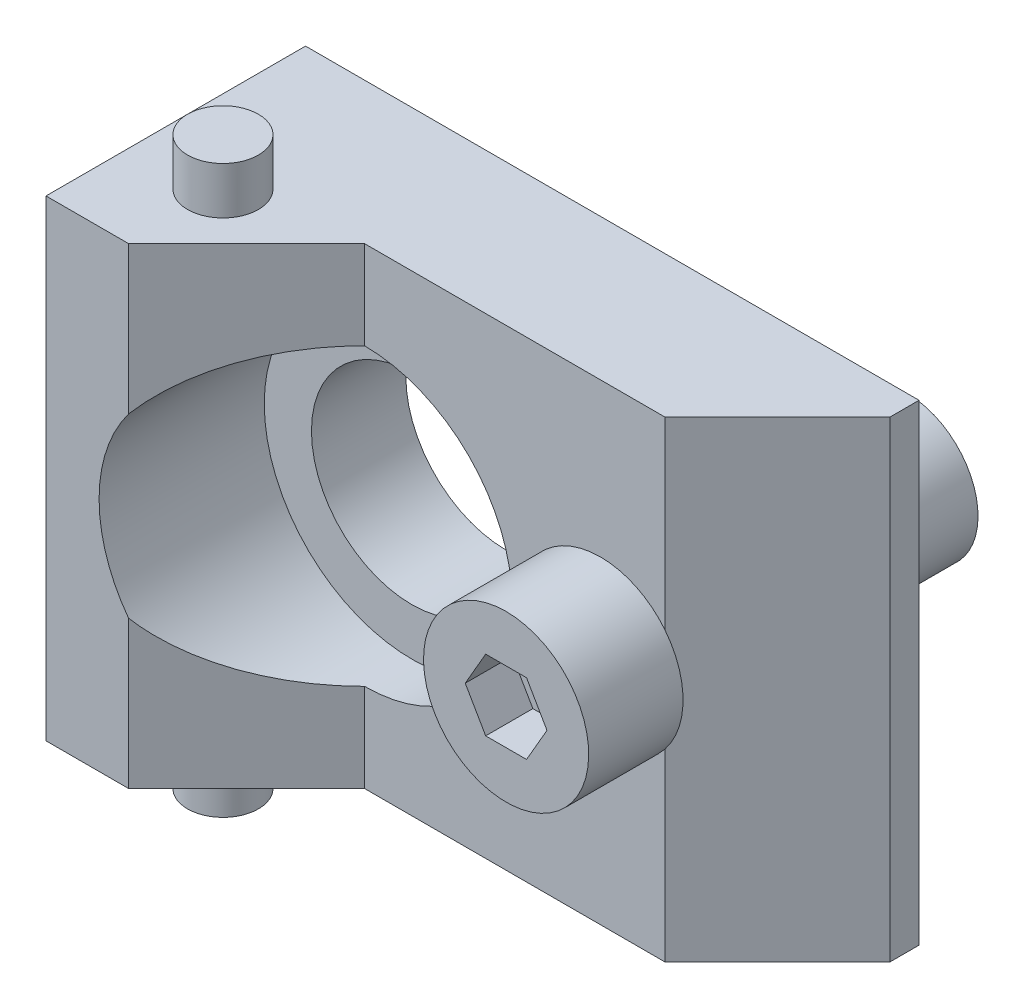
ISO-10303-21;
HEADER;
FILE_DESCRIPTION(('STEP AP214'),'2;1');
FILE_NAME('part.step','',(''),(''),'','','');
FILE_SCHEMA(('AUTOMOTIVE_DESIGN { 1 0 10303 214 1 1 1 1 }'));
ENDSEC;
DATA;
#1=APPLICATION_CONTEXT('core data for automotive mechanical design processes');
#2=APPLICATION_PROTOCOL_DEFINITION('international standard','automotive_design',2000,#1);
#3=PRODUCT_CONTEXT('',#1,'mechanical');
#4=PRODUCT('Part','Part','',(#3));
#5=PRODUCT_RELATED_PRODUCT_CATEGORY('part','',(#4));
#6=PRODUCT_DEFINITION_FORMATION('','',#4);
#7=PRODUCT_DEFINITION_CONTEXT('part definition',#1,'design');
#8=PRODUCT_DEFINITION('design','',#6,#7);
#9=PRODUCT_DEFINITION_SHAPE('','',#8);
#10=(LENGTH_UNIT() NAMED_UNIT(*) SI_UNIT(.MILLI.,.METRE.));
#11=(NAMED_UNIT(*) PLANE_ANGLE_UNIT() SI_UNIT($,.RADIAN.));
#12=(NAMED_UNIT(*) SI_UNIT($,.STERADIAN.) SOLID_ANGLE_UNIT());
#13=UNCERTAINTY_MEASURE_WITH_UNIT(LENGTH_MEASURE(1.E-05),#10,'distance_accuracy_value','');
#14=(GEOMETRIC_REPRESENTATION_CONTEXT(3) GLOBAL_UNCERTAINTY_ASSIGNED_CONTEXT((#13)) GLOBAL_UNIT_ASSIGNED_CONTEXT((#10,
#11,#12)) REPRESENTATION_CONTEXT('',''));
#15=CARTESIAN_POINT('',(0.,0.,0.));
#16=DIRECTION('',(0.,0.,1.));
#17=DIRECTION('',(1.,0.,0.));
#18=AXIS2_PLACEMENT_3D('',#15,#16,#17);
#19=CARTESIAN_POINT('',(-15.,-12.,7.));
#20=DIRECTION('',(0.,1.,0.));
#21=DIRECTION('',(1.,0.,0.));
#22=AXIS2_PLACEMENT_3D('',#19,#20,#21);
#23=CYLINDRICAL_SURFACE('',#22,1.5);
#24=CARTESIAN_POINT('',(-15.,-12.,7.));
#25=DIRECTION('',(0.,-1.,0.));
#26=DIRECTION('',(-1.,0.,0.));
#27=AXIS2_PLACEMENT_3D('',#24,#25,#26);
#28=CIRCLE('',#27,1.5);
#29=CARTESIAN_POINT('',(-16.5,-12.,7.00000000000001));
#30=VERTEX_POINT('',#29);
#31=EDGE_CURVE('E21',#30,#30,#28,.T.);
#32=ORIENTED_EDGE('',*,*,#31,.F.);
#33=EDGE_LOOP('',(#32));
#34=FACE_BOUND('',#33,.T.);
#35=CARTESIAN_POINT('',(-15.,-10.,7.));
#36=DIRECTION('',(0.,1.,0.));
#37=DIRECTION('',(0.,0.,1.));
#38=AXIS2_PLACEMENT_3D('',#35,#36,#37);
#39=CIRCLE('',#38,1.5);
#40=CARTESIAN_POINT('',(-15.,-10.,8.5));
#41=VERTEX_POINT('',#40);
#42=EDGE_CURVE('E9',#41,#41,#39,.T.);
#43=ORIENTED_EDGE('',*,*,#42,.F.);
#44=EDGE_LOOP('',(#43));
#45=FACE_BOUND('',#44,.T.);
#46=ADVANCED_FACE('F14',(#34,#45),#23,.T.);
#47=CARTESIAN_POINT('',(-15.,-12.,7.));
#48=DIRECTION('',(0.,-1.,0.));
#49=DIRECTION('',(-1.,0.,0.));
#50=AXIS2_PLACEMENT_3D('',#47,#48,#49);
#51=PLANE('',#50);
#52=ORIENTED_EDGE('',*,*,#31,.T.);
#53=EDGE_LOOP('',(#52));
#54=FACE_BOUND('',#53,.T.);
#55=ADVANCED_FACE('F239',(#54),#51,.T.);
#56=CARTESIAN_POINT('',(-0.866025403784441,1.5,8.));
#57=DIRECTION('',(0.,0.,1.));
#58=DIRECTION('',(0.,1.,0.));
#59=AXIS2_PLACEMENT_3D('',#56,#57,#58);
#60=PLANE('',#59);
#61=DIRECTION('',(0.5,0.86602540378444,0.));
#62=VECTOR('',#61,1.);
#63=CARTESIAN_POINT('',(-1.73205080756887,0.,8.));
#64=LINE('',#63,#62);
#65=CARTESIAN_POINT('',(-1.73205080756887,0.,8.));
#66=VERTEX_POINT('',#65);
#67=CARTESIAN_POINT('',(-0.866025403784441,1.5,8.));
#68=VERTEX_POINT('',#67);
#69=EDGE_CURVE('E174',#66,#68,#64,.T.);
#70=ORIENTED_EDGE('',*,*,#69,.F.);
#71=DIRECTION('',(0.5,-0.86602540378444,0.));
#72=VECTOR('',#71,1.);
#73=CARTESIAN_POINT('',(-1.73205080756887,0.,8.));
#74=LINE('',#73,#72);
#75=CARTESIAN_POINT('',(-0.866025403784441,-1.5,8.));
#76=VERTEX_POINT('',#75);
#77=EDGE_CURVE('E189',#66,#76,#74,.T.);
#78=ORIENTED_EDGE('',*,*,#77,.T.);
#79=DIRECTION('',(1.,0.,0.));
#80=VECTOR('',#79,1.);
#81=CARTESIAN_POINT('',(-0.866025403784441,-1.5,8.));
#82=LINE('',#81,#80);
#83=CARTESIAN_POINT('',(0.866025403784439,-1.5,8.));
#84=VERTEX_POINT('',#83);
#85=EDGE_CURVE('E193',#76,#84,#82,.T.);
#86=ORIENTED_EDGE('',*,*,#85,.T.);
#87=DIRECTION('',(-0.5,-0.86602540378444,0.));
#88=VECTOR('',#87,1.);
#89=CARTESIAN_POINT('',(1.73205080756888,0.,8.));
#90=LINE('',#89,#88);
#91=CARTESIAN_POINT('',(1.73205080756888,0.,8.));
#92=VERTEX_POINT('',#91);
#93=EDGE_CURVE('E196',#92,#84,#90,.T.);
#94=ORIENTED_EDGE('',*,*,#93,.F.);
#95=DIRECTION('',(-0.5,0.86602540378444,0.));
#96=VECTOR('',#95,1.);
#97=CARTESIAN_POINT('',(1.73205080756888,0.,8.));
#98=LINE('',#97,#96);
#99=CARTESIAN_POINT('',(0.866025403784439,1.5,8.));
#100=VERTEX_POINT('',#99);
#101=EDGE_CURVE('E199',#92,#100,#98,.T.);
#102=ORIENTED_EDGE('',*,*,#101,.T.);
#103=DIRECTION('',(-1.,0.,0.));
#104=VECTOR('',#103,1.);
#105=CARTESIAN_POINT('',(0.866025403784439,1.5,8.));
#106=LINE('',#105,#104);
#107=EDGE_CURVE('E202',#100,#68,#106,.T.);
#108=ORIENTED_EDGE('',*,*,#107,.T.);
#109=EDGE_LOOP('',(#70,#78,#86,#94,#102,#108));
#110=FACE_BOUND('',#109,.T.);
#111=ADVANCED_FACE('F257',(#110),#60,.T.);
#112=CARTESIAN_POINT('',(-0.866025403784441,-1.5,8.));
#113=DIRECTION('',(0.,-1.,0.));
#114=DIRECTION('',(1.,0.,0.));
#115=AXIS2_PLACEMENT_3D('',#112,#113,#114);
#116=PLANE('',#115);
#117=DIRECTION('',(0.,0.,1.));
#118=VECTOR('',#117,1.);
#119=CARTESIAN_POINT('',(-0.866025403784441,-1.5,8.));
#120=LINE('',#119,#118);
#121=CARTESIAN_POINT('',(-0.866025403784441,-1.5,10.));
#122=VERTEX_POINT('',#121);
#123=EDGE_CURVE('E209',#76,#122,#120,.T.);
#124=ORIENTED_EDGE('',*,*,#123,.T.);
#125=DIRECTION('',(1.,0.,0.));
#126=VECTOR('',#125,1.);
#127=CARTESIAN_POINT('',(-0.866025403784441,-1.5,10.));
#128=LINE('',#127,#126);
#129=CARTESIAN_POINT('',(0.866025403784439,-1.5,10.));
#130=VERTEX_POINT('',#129);
#131=EDGE_CURVE('E175',#122,#130,#128,.T.);
#132=ORIENTED_EDGE('',*,*,#131,.T.);
#133=DIRECTION('',(0.,0.,1.));
#134=VECTOR('',#133,1.);
#135=CARTESIAN_POINT('',(0.866025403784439,-1.5,8.));
#136=LINE('',#135,#134);
#137=EDGE_CURVE('E211',#84,#130,#136,.T.);
#138=ORIENTED_EDGE('',*,*,#137,.F.);
#139=ORIENTED_EDGE('',*,*,#85,.F.);
#140=EDGE_LOOP('',(#124,#132,#138,#139));
#141=FACE_BOUND('',#140,.T.);
#142=ADVANCED_FACE('F259',(#141),#116,.F.);
#143=CARTESIAN_POINT('',(1.73205080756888,0.,8.));
#144=DIRECTION('',(-0.86602540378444,0.5,0.));
#145=DIRECTION('',(-0.5,-0.86602540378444,0.));
#146=AXIS2_PLACEMENT_3D('',#143,#144,#145);
#147=PLANE('',#146);
#148=ORIENTED_EDGE('',*,*,#137,.T.);
#149=DIRECTION('',(-0.5,-0.86602540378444,0.));
#150=VECTOR('',#149,1.);
#151=CARTESIAN_POINT('',(1.73205080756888,0.,10.));
#152=LINE('',#151,#150);
#153=CARTESIAN_POINT('',(1.73205080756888,0.,10.));
#154=VERTEX_POINT('',#153);
#155=EDGE_CURVE('E178',#154,#130,#152,.T.);
#156=ORIENTED_EDGE('',*,*,#155,.F.);
#157=DIRECTION('',(0.,0.,1.));
#158=VECTOR('',#157,1.);
#159=CARTESIAN_POINT('',(1.73205080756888,0.,8.));
#160=LINE('',#159,#158);
#161=EDGE_CURVE('E213',#92,#154,#160,.T.);
#162=ORIENTED_EDGE('',*,*,#161,.F.);
#163=ORIENTED_EDGE('',*,*,#93,.T.);
#164=EDGE_LOOP('',(#148,#156,#162,#163));
#165=FACE_BOUND('',#164,.T.);
#166=ADVANCED_FACE('F267',(#165),#147,.T.);
#167=CARTESIAN_POINT('',(1.73205080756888,0.,8.));
#168=DIRECTION('',(0.86602540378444,0.5,0.));
#169=DIRECTION('',(-0.5,0.86602540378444,0.));
#170=AXIS2_PLACEMENT_3D('',#167,#168,#169);
#171=PLANE('',#170);
#172=ORIENTED_EDGE('',*,*,#161,.T.);
#173=DIRECTION('',(-0.5,0.86602540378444,0.));
#174=VECTOR('',#173,1.);
#175=CARTESIAN_POINT('',(1.73205080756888,0.,10.));
#176=LINE('',#175,#174);
#177=CARTESIAN_POINT('',(0.866025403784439,1.5,10.));
#178=VERTEX_POINT('',#177);
#179=EDGE_CURVE('E181',#154,#178,#176,.T.);
#180=ORIENTED_EDGE('',*,*,#179,.T.);
#181=DIRECTION('',(0.,0.,1.));
#182=VECTOR('',#181,1.);
#183=CARTESIAN_POINT('',(0.866025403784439,1.5,8.));
#184=LINE('',#183,#182);
#185=EDGE_CURVE('E215',#100,#178,#184,.T.);
#186=ORIENTED_EDGE('',*,*,#185,.F.);
#187=ORIENTED_EDGE('',*,*,#101,.F.);
#188=EDGE_LOOP('',(#172,#180,#186,#187));
#189=FACE_BOUND('',#188,.T.);
#190=ADVANCED_FACE('F287',(#189),#171,.F.);
#191=CARTESIAN_POINT('',(0.866025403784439,1.5,8.));
#192=DIRECTION('',(0.,1.,0.));
#193=DIRECTION('',(-1.,0.,0.));
#194=AXIS2_PLACEMENT_3D('',#191,#192,#193);
#195=PLANE('',#194);
#196=ORIENTED_EDGE('',*,*,#185,.T.);
#197=DIRECTION('',(-1.,0.,0.));
#198=VECTOR('',#197,1.);
#199=CARTESIAN_POINT('',(0.866025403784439,1.5,10.));
#200=LINE('',#199,#198);
#201=CARTESIAN_POINT('',(-0.866025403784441,1.5,10.));
#202=VERTEX_POINT('',#201);
#203=EDGE_CURVE('E184',#178,#202,#200,.T.);
#204=ORIENTED_EDGE('',*,*,#203,.T.);
#205=DIRECTION('',(0.,0.,1.));
#206=VECTOR('',#205,1.);
#207=CARTESIAN_POINT('',(-0.866025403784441,1.5,8.));
#208=LINE('',#207,#206);
#209=EDGE_CURVE('E217',#68,#202,#208,.T.);
#210=ORIENTED_EDGE('',*,*,#209,.F.);
#211=ORIENTED_EDGE('',*,*,#107,.F.);
#212=EDGE_LOOP('',(#196,#204,#210,#211));
#213=FACE_BOUND('',#212,.T.);
#214=ADVANCED_FACE('F279',(#213),#195,.F.);
#215=CARTESIAN_POINT('',(-1.73205080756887,0.,8.));
#216=DIRECTION('',(0.86602540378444,-0.5,0.));
#217=DIRECTION('',(0.5,0.86602540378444,0.));
#218=AXIS2_PLACEMENT_3D('',#215,#216,#217);
#219=PLANE('',#218);
#220=ORIENTED_EDGE('',*,*,#209,.T.);
#221=DIRECTION('',(0.5,0.86602540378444,0.));
#222=VECTOR('',#221,1.);
#223=CARTESIAN_POINT('',(-1.73205080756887,0.,10.));
#224=LINE('',#223,#222);
#225=CARTESIAN_POINT('',(-1.73205080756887,0.,10.));
#226=VERTEX_POINT('',#225);
#227=EDGE_CURVE('E170',#226,#202,#224,.T.);
#228=ORIENTED_EDGE('',*,*,#227,.F.);
#229=DIRECTION('',(0.,0.,1.));
#230=VECTOR('',#229,1.);
#231=CARTESIAN_POINT('',(-1.73205080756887,0.,8.));
#232=LINE('',#231,#230);
#233=EDGE_CURVE('E192',#66,#226,#232,.T.);
#234=ORIENTED_EDGE('',*,*,#233,.F.);
#235=ORIENTED_EDGE('',*,*,#69,.T.);
#236=EDGE_LOOP('',(#220,#228,#234,#235));
#237=FACE_BOUND('',#236,.T.);
#238=ADVANCED_FACE('F275',(#237),#219,.T.);
#239=CARTESIAN_POINT('',(-1.73205080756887,0.,8.));
#240=DIRECTION('',(-0.86602540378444,-0.5,0.));
#241=DIRECTION('',(0.5,-0.86602540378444,0.));
#242=AXIS2_PLACEMENT_3D('',#239,#240,#241);
#243=PLANE('',#242);
#244=ORIENTED_EDGE('',*,*,#77,.F.);
#245=ORIENTED_EDGE('',*,*,#233,.T.);
#246=DIRECTION('',(0.5,-0.86602540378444,0.));
#247=VECTOR('',#246,1.);
#248=CARTESIAN_POINT('',(-1.73205080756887,0.,10.));
#249=LINE('',#248,#247);
#250=EDGE_CURVE('E171',#226,#122,#249,.T.);
#251=ORIENTED_EDGE('',*,*,#250,.T.);
#252=ORIENTED_EDGE('',*,*,#123,.F.);
#253=EDGE_LOOP('',(#244,#245,#251,#252));
#254=FACE_BOUND('',#253,.T.);
#255=ADVANCED_FACE('F278',(#254),#243,.F.);
#256=CARTESIAN_POINT('',(-15.,12.,7.));
#257=DIRECTION('',(0.,1.,0.));
#258=DIRECTION('',(-1.,0.,0.));
#259=AXIS2_PLACEMENT_3D('',#256,#257,#258);
#260=PLANE('',#259);
#261=CARTESIAN_POINT('',(-15.,12.,7.));
#262=DIRECTION('',(0.,1.,0.));
#263=DIRECTION('',(-1.,0.,0.));
#264=AXIS2_PLACEMENT_3D('',#261,#262,#263);
#265=CIRCLE('',#264,1.5);
#266=CARTESIAN_POINT('',(-16.5,12.,6.99999999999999));
#267=VERTEX_POINT('',#266);
#268=EDGE_CURVE('E231',#267,#267,#265,.T.);
#269=ORIENTED_EDGE('',*,*,#268,.T.);
#270=EDGE_LOOP('',(#269));
#271=FACE_BOUND('',#270,.T.);
#272=ADVANCED_FACE('F282',(#271),#260,.T.);
#273=CARTESIAN_POINT('',(0.,0.,10.));
#274=DIRECTION('',(0.,0.,1.));
#275=DIRECTION('',(0.,1.,0.));
#276=AXIS2_PLACEMENT_3D('',#273,#274,#275);
#277=PLANE('',#276);
#278=CARTESIAN_POINT('',(0.,0.,10.));
#279=DIRECTION('',(0.,0.,1.));
#280=DIRECTION('',(0.,1.,0.));
#281=AXIS2_PLACEMENT_3D('',#278,#279,#280);
#282=CIRCLE('',#281,3.5);
#283=CARTESIAN_POINT('',(0.,3.5,10.));
#284=VERTEX_POINT('',#283);
#285=EDGE_CURVE('E221',#284,#284,#282,.T.);
#286=ORIENTED_EDGE('',*,*,#285,.T.);
#287=EDGE_LOOP('',(#286));
#288=FACE_BOUND('',#287,.T.);
#289=ORIENTED_EDGE('',*,*,#250,.F.);
#290=ORIENTED_EDGE('',*,*,#227,.T.);
#291=ORIENTED_EDGE('',*,*,#203,.F.);
#292=ORIENTED_EDGE('',*,*,#179,.F.);
#293=ORIENTED_EDGE('',*,*,#155,.T.);
#294=ORIENTED_EDGE('',*,*,#131,.F.);
#295=EDGE_LOOP('',(#289,#290,#291,#292,#293,#294));
#296=FACE_BOUND('',#295,.T.);
#297=ADVANCED_FACE('F304',(#288,#296),#277,.T.);
#298=CARTESIAN_POINT('',(0.,0.,-7.));
#299=DIRECTION('',(0.,0.,-1.));
#300=DIRECTION('',(0.898965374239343,0.438019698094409,0.));
#301=AXIS2_PLACEMENT_3D('',#298,#299,#300);
#302=PLANE('',#301);
#303=CARTESIAN_POINT('',(0.,0.,-7.));
#304=DIRECTION('',(0.,0.,-1.));
#305=DIRECTION('',(0.898965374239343,0.438019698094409,0.));
#306=AXIS2_PLACEMENT_3D('',#303,#304,#305);
#307=CIRCLE('',#306,3.);
#308=CARTESIAN_POINT('',(2.69689612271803,1.31405909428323,-7.));
#309=VERTEX_POINT('',#308);
#310=EDGE_CURVE('E225',#309,#309,#307,.T.);
#311=ORIENTED_EDGE('',*,*,#310,.T.);
#312=EDGE_LOOP('',(#311));
#313=FACE_BOUND('',#312,.T.);
#314=ADVANCED_FACE('F307',(#313),#302,.T.);
#315=CARTESIAN_POINT('',(-15.,12.,7.));
#316=DIRECTION('',(0.,-1.,0.));
#317=DIRECTION('',(1.,0.,0.));
#318=AXIS2_PLACEMENT_3D('',#315,#316,#317);
#319=CYLINDRICAL_SURFACE('',#318,1.5);
#320=ORIENTED_EDGE('',*,*,#268,.F.);
#321=EDGE_LOOP('',(#320));
#322=FACE_BOUND('',#321,.T.);
#323=CARTESIAN_POINT('',(-15.,10.,7.));
#324=DIRECTION('',(0.,-1.,0.));
#325=DIRECTION('',(1.,0.,0.));
#326=AXIS2_PLACEMENT_3D('',#323,#324,#325);
#327=CIRCLE('',#326,1.5);
#328=CARTESIAN_POINT('',(-13.5,10.,7.));
#329=VERTEX_POINT('',#328);
#330=EDGE_CURVE('E234',#329,#329,#327,.T.);
#331=ORIENTED_EDGE('',*,*,#330,.F.);
#332=EDGE_LOOP('',(#331));
#333=FACE_BOUND('',#332,.T.);
#334=ADVANCED_FACE('F311',(#322,#333),#319,.T.);
#335=CARTESIAN_POINT('',(-10.,0.,4.));
#336=DIRECTION('',(0.,0.,1.));
#337=DIRECTION('',(-1.,0.,0.));
#338=AXIS2_PLACEMENT_3D('',#335,#336,#337);
#339=PLANE('',#338);
#340=CARTESIAN_POINT('',(-10.,0.,4.));
#341=DIRECTION('',(0.,0.,1.));
#342=DIRECTION('',(-1.,0.,0.));
#343=AXIS2_PLACEMENT_3D('',#340,#341,#342);
#344=CIRCLE('',#343,6.25);
#345=CARTESIAN_POINT('',(-16.25,0.,4.));
#346=VERTEX_POINT('',#345);
#347=EDGE_CURVE('E162',#346,#346,#344,.T.);
#348=ORIENTED_EDGE('',*,*,#347,.T.);
#349=EDGE_LOOP('',(#348));
#350=FACE_BOUND('',#349,.T.);
#351=CARTESIAN_POINT('',(-10.,0.,4.));
#352=DIRECTION('',(0.,0.,1.));
#353=DIRECTION('',(-1.,0.,0.));
#354=AXIS2_PLACEMENT_3D('',#351,#352,#353);
#355=CIRCLE('',#354,4.24999999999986);
#356=CARTESIAN_POINT('',(-14.2499999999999,0.,4.));
#357=VERTEX_POINT('',#356);
#358=EDGE_CURVE('E158',#357,#357,#355,.F.);
#359=ORIENTED_EDGE('',*,*,#358,.T.);
#360=EDGE_LOOP('',(#359));
#361=FACE_BOUND('',#360,.T.);
#362=ADVANCED_FACE('F303',(#350,#361),#339,.T.);
#363=CARTESIAN_POINT('',(0.,0.,18.));
#364=DIRECTION('',(0.,0.,1.));
#365=DIRECTION('',(0.,1.,0.));
#366=AXIS2_PLACEMENT_3D('',#363,#364,#365);
#367=CYLINDRICAL_SURFACE('',#366,3.5);
#368=CARTESIAN_POINT('',(0.,0.,6.));
#369=DIRECTION('',(0.,0.,1.));
#370=DIRECTION('',(0.,1.,0.));
#371=AXIS2_PLACEMENT_3D('',#368,#369,#370);
#372=CIRCLE('',#371,3.5);
#373=CARTESIAN_POINT('',(2.727922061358,-2.19281582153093,6.));
#374=VERTEX_POINT('',#373);
#375=CARTESIAN_POINT('',(2.727922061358,2.19281582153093,6.));
#376=VERTEX_POINT('',#375);
#377=EDGE_CURVE('E219',#374,#376,#372,.T.);
#378=ORIENTED_EDGE('',*,*,#377,.T.);
#379=EDGE_CURVE('E28',#376,#374,#372,.T.);
#380=ORIENTED_EDGE('',*,*,#379,.T.);
#381=EDGE_LOOP('',(#378,#380));
#382=FACE_BOUND('',#381,.T.);
#383=ORIENTED_EDGE('',*,*,#285,.F.);
#384=EDGE_LOOP('',(#383));
#385=FACE_BOUND('',#384,.T.);
#386=ADVANCED_FACE('F299',(#382,#385),#367,.T.);
#387=CARTESIAN_POINT('',(0.,3.5,6.));
#388=DIRECTION('',(0.,0.,-1.));
#389=DIRECTION('',(0.,-1.,0.));
#390=AXIS2_PLACEMENT_3D('',#387,#388,#389);
#391=PLANE('',#390);
#392=ORIENTED_EDGE('',*,*,#377,.F.);
#393=DIRECTION('',(0.,1.,0.));
#394=VECTOR('',#393,1.);
#395=CARTESIAN_POINT('',(2.727922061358,-10.,6.));
#396=LINE('',#395,#394);
#397=EDGE_CURVE('E224',#374,#376,#396,.T.);
#398=ORIENTED_EDGE('',*,*,#397,.T.);
#399=EDGE_LOOP('',(#392,#398));
#400=FACE_BOUND('',#399,.T.);
#401=ADVANCED_FACE('F295',(#400),#391,.T.);
#402=CARTESIAN_POINT('',(0.,0.,-7.));
#403=DIRECTION('',(0.,0.,1.));
#404=DIRECTION('',(-0.898965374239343,-0.438019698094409,0.));
#405=AXIS2_PLACEMENT_3D('',#402,#403,#404);
#406=CYLINDRICAL_SURFACE('',#405,3.);
#407=ORIENTED_EDGE('',*,*,#310,.F.);
#408=EDGE_LOOP('',(#407));
#409=FACE_BOUND('',#408,.T.);
#410=CARTESIAN_POINT('',(0.,0.,0.));
#411=DIRECTION('',(0.,0.,1.));
#412=DIRECTION('',(0.,-1.,0.));
#413=AXIS2_PLACEMENT_3D('',#410,#411,#412);
#414=CIRCLE('',#413,3.);
#415=CARTESIAN_POINT('',(0.,-3.,0.));
#416=VERTEX_POINT('',#415);
#417=EDGE_CURVE('E228',#416,#416,#414,.T.);
#418=ORIENTED_EDGE('',*,*,#417,.F.);
#419=EDGE_LOOP('',(#418));
#420=FACE_BOUND('',#419,.T.);
#421=ADVANCED_FACE('F298',(#409,#420),#406,.T.);
#422=CARTESIAN_POINT('',(-10.,0.,12.));
#423=DIRECTION('',(0.,0.,1.));
#424=DIRECTION('',(-1.,0.,0.));
#425=AXIS2_PLACEMENT_3D('',#422,#423,#424);
#426=CYLINDRICAL_SURFACE('',#425,4.24999999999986);
#427=CARTESIAN_POINT('',(-10.,0.,0.));
#428=DIRECTION('',(0.,0.,1.));
#429=DIRECTION('',(-1.,0.,0.));
#430=AXIS2_PLACEMENT_3D('',#427,#428,#429);
#431=CIRCLE('',#430,4.24999999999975);
#432=CARTESIAN_POINT('',(-14.2499999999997,0.,0.));
#433=VERTEX_POINT('',#432);
#434=EDGE_CURVE('E161',#433,#433,#431,.T.);
#435=ORIENTED_EDGE('',*,*,#434,.F.);
#436=EDGE_LOOP('',(#435));
#437=FACE_BOUND('',#436,.T.);
#438=ORIENTED_EDGE('',*,*,#358,.F.);
#439=EDGE_LOOP('',(#438));
#440=FACE_BOUND('',#439,.T.);
#441=ADVANCED_FACE('F315',(#437,#440),#426,.F.);
#442=CARTESIAN_POINT('',(7.5,10.,12.));
#443=DIRECTION('',(0.,-1.,0.));
#444=DIRECTION('',(1.,0.,0.));
#445=AXIS2_PLACEMENT_3D('',#442,#443,#444);
#446=PLANE('',#445);
#447=DIRECTION('',(-1.,0.,0.));
#448=VECTOR('',#447,1.);
#449=CARTESIAN_POINT('',(-16.,10.,11.));
#450=LINE('',#449,#448);
#451=CARTESIAN_POINT('',(-15.,10.,11.));
#452=VERTEX_POINT('',#451);
#453=CARTESIAN_POINT('',(-18.5,10.,11.));
#454=VERTEX_POINT('',#453);
#455=EDGE_CURVE('E124',#452,#454,#450,.T.);
#456=ORIENTED_EDGE('',*,*,#455,.F.);
#457=DIRECTION('',(-0.707106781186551,0.,0.707106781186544));
#458=VECTOR('',#457,1.);
#459=CARTESIAN_POINT('',(-16.,10.,12.));
#460=LINE('',#459,#458);
#461=CARTESIAN_POINT('',(-10.,10.,6.));
#462=VERTEX_POINT('',#461);
#463=EDGE_CURVE('E417',#462,#452,#460,.T.);
#464=ORIENTED_EDGE('',*,*,#463,.F.);
#465=DIRECTION('',(-1.,0.,0.));
#466=VECTOR('',#465,1.);
#467=CARTESIAN_POINT('',(2.727922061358,10.,6.));
#468=LINE('',#467,#466);
#469=CARTESIAN_POINT('',(2.727922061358,10.,6.));
#470=VERTEX_POINT('',#469);
#471=EDGE_CURVE('E418',#470,#462,#468,.T.);
#472=ORIENTED_EDGE('',*,*,#471,.F.);
#473=DIRECTION('',(-0.707106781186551,0.,0.707106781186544));
#474=VECTOR('',#473,1.);
#475=CARTESIAN_POINT('',(2.727922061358,10.,6.));
#476=LINE('',#475,#474);
#477=CARTESIAN_POINT('',(7.5,10.,1.22792206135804));
#478=VERTEX_POINT('',#477);
#479=EDGE_CURVE('E382',#478,#470,#476,.T.);
#480=ORIENTED_EDGE('',*,*,#479,.F.);
#481=DIRECTION('',(0.,0.,-1.));
#482=VECTOR('',#481,1.);
#483=CARTESIAN_POINT('',(7.5,10.,12.));
#484=LINE('',#483,#482);
#485=CARTESIAN_POINT('',(7.5,10.,0.));
#486=VERTEX_POINT('',#485);
#487=EDGE_CURVE('E150',#478,#486,#484,.T.);
#488=ORIENTED_EDGE('',*,*,#487,.T.);
#489=DIRECTION('',(-1.,0.,0.));
#490=VECTOR('',#489,1.);
#491=CARTESIAN_POINT('',(7.5,10.,0.));
#492=LINE('',#491,#490);
#493=CARTESIAN_POINT('',(-18.5,10.,0.));
#494=VERTEX_POINT('',#493);
#495=EDGE_CURVE('E148',#486,#494,#492,.T.);
#496=ORIENTED_EDGE('',*,*,#495,.T.);
#497=DIRECTION('',(0.,0.,-1.));
#498=VECTOR('',#497,1.);
#499=CARTESIAN_POINT('',(-18.5,10.,12.));
#500=LINE('',#499,#498);
#501=EDGE_CURVE('E140',#454,#494,#500,.T.);
#502=ORIENTED_EDGE('',*,*,#501,.F.);
#503=EDGE_LOOP('',(#456,#464,#472,#480,#488,#496,#502));
#504=FACE_BOUND('',#503,.T.);
#505=ORIENTED_EDGE('',*,*,#330,.T.);
#506=EDGE_LOOP('',(#505));
#507=FACE_BOUND('',#506,.T.);
#508=ADVANCED_FACE('F145',(#504,#507),#446,.F.);
#509=CARTESIAN_POINT('',(-16.,-10.,12.));
#510=DIRECTION('',(-0.707106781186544,0.,-0.707106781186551));
#511=DIRECTION('',(0.707106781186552,0.,-0.707106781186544));
#512=AXIS2_PLACEMENT_3D('',#509,#510,#511);
#513=PLANE('',#512);
#514=DIRECTION('',(0.,1.,0.));
#515=VECTOR('',#514,1.);
#516=CARTESIAN_POINT('',(-15.,-10.,11.));
#517=LINE('',#516,#515);
#518=CARTESIAN_POINT('',(-15.,3.75,11.));
#519=VERTEX_POINT('',#518);
#520=EDGE_CURVE('E130',#519,#452,#517,.T.);
#521=ORIENTED_EDGE('',*,*,#520,.F.);
#522=CARTESIAN_POINT('',(-10.,0.,6.));
#523=DIRECTION('',(-0.707106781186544,0.,-0.707106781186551));
#524=DIRECTION('',(-0.707106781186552,0.,0.707106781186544));
#525=AXIS2_PLACEMENT_3D('',#522,#523,#524);
#526=ELLIPSE('',#525,8.8388347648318,6.25);
#527=CARTESIAN_POINT('',(-10.,6.25,6.));
#528=VERTEX_POINT('',#527);
#529=EDGE_CURVE('E165',#528,#519,#526,.F.);
#530=ORIENTED_EDGE('',*,*,#529,.F.);
#531=DIRECTION('',(0.,1.,0.));
#532=VECTOR('',#531,1.);
#533=CARTESIAN_POINT('',(-10.,-10.,6.));
#534=LINE('',#533,#532);
#535=EDGE_CURVE('E398',#528,#462,#534,.T.);
#536=ORIENTED_EDGE('',*,*,#535,.T.);
#537=ORIENTED_EDGE('',*,*,#463,.T.);
#538=EDGE_LOOP('',(#521,#530,#536,#537));
#539=FACE_BOUND('',#538,.T.);
#540=ADVANCED_FACE('F332',(#539),#513,.F.);
#541=CARTESIAN_POINT('',(-10.,0.,4.));
#542=DIRECTION('',(0.,0.,1.));
#543=DIRECTION('',(-1.,0.,0.));
#544=AXIS2_PLACEMENT_3D('',#541,#542,#543);
#545=CYLINDRICAL_SURFACE('',#544,6.25);
#546=ORIENTED_EDGE('',*,*,#347,.F.);
#547=EDGE_LOOP('',(#546));
#548=FACE_BOUND('',#547,.T.);
#549=CARTESIAN_POINT('',(-10.,0.,11.));
#550=DIRECTION('',(0.,0.,1.));
#551=DIRECTION('',(-1.,0.,0.));
#552=AXIS2_PLACEMENT_3D('',#549,#550,#551);
#553=CIRCLE('',#552,6.25);
#554=CARTESIAN_POINT('',(-15.,-3.75,11.));
#555=VERTEX_POINT('',#554);
#556=EDGE_CURVE('E383',#555,#519,#553,.F.);
#557=ORIENTED_EDGE('',*,*,#556,.F.);
#558=CARTESIAN_POINT('',(-10.,-6.25,6.));
#559=VERTEX_POINT('',#558);
#560=EDGE_CURVE('E168',#555,#559,#526,.F.);
#561=ORIENTED_EDGE('',*,*,#560,.T.);
#562=CARTESIAN_POINT('',(-10.,0.,6.));
#563=DIRECTION('',(0.,0.,-1.));
#564=DIRECTION('',(1.,0.,0.));
#565=AXIS2_PLACEMENT_3D('',#562,#563,#564);
#566=CIRCLE('',#565,6.25);
#567=EDGE_CURVE('E152',#559,#528,#566,.F.);
#568=ORIENTED_EDGE('',*,*,#567,.T.);
#569=ORIENTED_EDGE('',*,*,#529,.T.);
#570=EDGE_LOOP('',(#557,#561,#568,#569));
#571=FACE_BOUND('',#570,.T.);
#572=ADVANCED_FACE('F338',(#548,#571),#545,.F.);
#573=DIRECTION('',(0.,1.,0.));
#574=VECTOR('',#573,1.);
#575=CARTESIAN_POINT('',(-15.,-10.,11.));
#576=LINE('',#575,#574);
#577=CARTESIAN_POINT('',(-15.,-10.,11.));
#578=VERTEX_POINT('',#577);
#579=EDGE_CURVE('E376',#578,#555,#576,.T.);
#580=ORIENTED_EDGE('',*,*,#579,.F.);
#581=DIRECTION('',(-0.707106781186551,0.,0.707106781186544));
#582=VECTOR('',#581,1.);
#583=CARTESIAN_POINT('',(-16.,-10.,12.));
#584=LINE('',#583,#582);
#585=CARTESIAN_POINT('',(-10.,-10.,6.));
#586=VERTEX_POINT('',#585);
#587=EDGE_CURVE('E379',#586,#578,#584,.T.);
#588=ORIENTED_EDGE('',*,*,#587,.F.);
#589=EDGE_CURVE('E396',#586,#559,#534,.T.);
#590=ORIENTED_EDGE('',*,*,#589,.T.);
#591=ORIENTED_EDGE('',*,*,#560,.F.);
#592=EDGE_LOOP('',(#580,#588,#590,#591));
#593=FACE_BOUND('',#592,.T.);
#594=ADVANCED_FACE('F341',(#593),#513,.F.);
#595=CARTESIAN_POINT('',(2.727922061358,-10.,6.));
#596=DIRECTION('',(0.,0.,-1.));
#597=DIRECTION('',(1.,0.,0.));
#598=AXIS2_PLACEMENT_3D('',#595,#596,#597);
#599=PLANE('',#598);
#600=ORIENTED_EDGE('',*,*,#379,.F.);
#601=EDGE_CURVE('E388',#376,#470,#396,.T.);
#602=ORIENTED_EDGE('',*,*,#601,.T.);
#603=ORIENTED_EDGE('',*,*,#471,.T.);
#604=ORIENTED_EDGE('',*,*,#535,.F.);
#605=ORIENTED_EDGE('',*,*,#567,.F.);
#606=ORIENTED_EDGE('',*,*,#589,.F.);
#607=DIRECTION('',(-1.,0.,0.));
#608=VECTOR('',#607,1.);
#609=CARTESIAN_POINT('',(2.727922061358,-10.,6.));
#610=LINE('',#609,#608);
#611=CARTESIAN_POINT('',(2.727922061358,-10.,6.));
#612=VERTEX_POINT('',#611);
#613=EDGE_CURVE('E387',#612,#586,#610,.T.);
#614=ORIENTED_EDGE('',*,*,#613,.F.);
#615=EDGE_CURVE('E390',#612,#374,#396,.T.);
#616=ORIENTED_EDGE('',*,*,#615,.T.);
#617=EDGE_LOOP('',(#600,#602,#603,#604,#605,#606,#614,#616));
#618=FACE_BOUND('',#617,.T.);
#619=ADVANCED_FACE('F365',(#618),#599,.F.);
#620=CARTESIAN_POINT('',(2.727922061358,-10.,6.));
#621=DIRECTION('',(-0.707106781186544,0.,-0.707106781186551));
#622=DIRECTION('',(0.707106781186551,0.,-0.707106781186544));
#623=AXIS2_PLACEMENT_3D('',#620,#621,#622);
#624=PLANE('',#623);
#625=ORIENTED_EDGE('',*,*,#479,.T.);
#626=ORIENTED_EDGE('',*,*,#601,.F.);
#627=ORIENTED_EDGE('',*,*,#397,.F.);
#628=ORIENTED_EDGE('',*,*,#615,.F.);
#629=DIRECTION('',(-0.707106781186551,0.,0.707106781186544));
#630=VECTOR('',#629,1.);
#631=CARTESIAN_POINT('',(2.727922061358,-10.,6.));
#632=LINE('',#631,#630);
#633=CARTESIAN_POINT('',(7.5,-10.,1.22792206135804));
#634=VERTEX_POINT('',#633);
#635=EDGE_CURVE('E392',#634,#612,#632,.T.);
#636=ORIENTED_EDGE('',*,*,#635,.F.);
#637=DIRECTION('',(0.,-1.,0.));
#638=VECTOR('',#637,1.);
#639=CARTESIAN_POINT('',(7.5,-10.,1.22792206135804));
#640=LINE('',#639,#638);
#641=EDGE_CURVE('E397',#478,#634,#640,.T.);
#642=ORIENTED_EDGE('',*,*,#641,.F.);
#643=EDGE_LOOP('',(#625,#626,#627,#628,#636,#642));
#644=FACE_BOUND('',#643,.T.);
#645=ADVANCED_FACE('F355',(#644),#624,.F.);
#646=CARTESIAN_POINT('',(7.5,-10.,12.));
#647=DIRECTION('',(-1.,0.,0.));
#648=DIRECTION('',(0.,0.,-1.));
#649=AXIS2_PLACEMENT_3D('',#646,#647,#648);
#650=PLANE('',#649);
#651=ORIENTED_EDGE('',*,*,#487,.F.);
#652=ORIENTED_EDGE('',*,*,#641,.T.);
#653=DIRECTION('',(0.,0.,-1.));
#654=VECTOR('',#653,1.);
#655=CARTESIAN_POINT('',(7.5,-10.,12.));
#656=LINE('',#655,#654);
#657=CARTESIAN_POINT('',(7.5,-10.,0.));
#658=VERTEX_POINT('',#657);
#659=EDGE_CURVE('E154',#634,#658,#656,.T.);
#660=ORIENTED_EDGE('',*,*,#659,.T.);
#661=DIRECTION('',(0.,1.,0.));
#662=VECTOR('',#661,1.);
#663=CARTESIAN_POINT('',(7.5,-10.,0.));
#664=LINE('',#663,#662);
#665=EDGE_CURVE('E406',#658,#486,#664,.T.);
#666=ORIENTED_EDGE('',*,*,#665,.T.);
#667=EDGE_LOOP('',(#651,#652,#660,#666));
#668=FACE_BOUND('',#667,.T.);
#669=ADVANCED_FACE('F273',(#668),#650,.F.);
#670=CARTESIAN_POINT('',(7.5,10.,0.));
#671=DIRECTION('',(0.,0.,1.));
#672=DIRECTION('',(-1.,0.,0.));
#673=AXIS2_PLACEMENT_3D('',#670,#671,#672);
#674=PLANE('',#673);
#675=ORIENTED_EDGE('',*,*,#665,.F.);
#676=DIRECTION('',(1.,0.,0.));
#677=VECTOR('',#676,1.);
#678=CARTESIAN_POINT('',(7.5,-10.,0.));
#679=LINE('',#678,#677);
#680=CARTESIAN_POINT('',(-18.5,-10.,0.));
#681=VERTEX_POINT('',#680);
#682=EDGE_CURVE('E412',#681,#658,#679,.T.);
#683=ORIENTED_EDGE('',*,*,#682,.F.);
#684=DIRECTION('',(0.,-1.,0.));
#685=VECTOR('',#684,1.);
#686=CARTESIAN_POINT('',(-18.5,-10.,0.));
#687=LINE('',#686,#685);
#688=EDGE_CURVE('E410',#494,#681,#687,.T.);
#689=ORIENTED_EDGE('',*,*,#688,.F.);
#690=ORIENTED_EDGE('',*,*,#495,.F.);
#691=EDGE_LOOP('',(#675,#683,#689,#690));
#692=FACE_BOUND('',#691,.T.);
#693=ORIENTED_EDGE('',*,*,#434,.T.);
#694=EDGE_LOOP('',(#693));
#695=FACE_BOUND('',#694,.T.);
#696=ORIENTED_EDGE('',*,*,#417,.T.);
#697=EDGE_LOOP('',(#696));
#698=FACE_BOUND('',#697,.T.);
#699=ADVANCED_FACE('F345',(#692,#695,#698),#674,.F.);
#700=CARTESIAN_POINT('',(-18.5,-10.,12.));
#701=DIRECTION('',(1.,0.,0.));
#702=DIRECTION('',(0.,0.,1.));
#703=AXIS2_PLACEMENT_3D('',#700,#701,#702);
#704=PLANE('',#703);
#705=DIRECTION('',(0.,-1.,0.));
#706=VECTOR('',#705,1.);
#707=CARTESIAN_POINT('',(-18.5,10.,11.));
#708=LINE('',#707,#706);
#709=CARTESIAN_POINT('',(-18.5,-10.,11.));
#710=VERTEX_POINT('',#709);
#711=EDGE_CURVE('E127',#454,#710,#708,.T.);
#712=ORIENTED_EDGE('',*,*,#711,.F.);
#713=ORIENTED_EDGE('',*,*,#501,.T.);
#714=ORIENTED_EDGE('',*,*,#688,.T.);
#715=DIRECTION('',(0.,0.,-1.));
#716=VECTOR('',#715,1.);
#717=CARTESIAN_POINT('',(-18.5,-10.,12.));
#718=LINE('',#717,#716);
#719=EDGE_CURVE('E142',#710,#681,#718,.T.);
#720=ORIENTED_EDGE('',*,*,#719,.F.);
#721=EDGE_LOOP('',(#712,#713,#714,#720));
#722=FACE_BOUND('',#721,.T.);
#723=ADVANCED_FACE('F138',(#722),#704,.F.);
#724=CARTESIAN_POINT('',(-18.5,10.,11.));
#725=DIRECTION('',(0.,0.,1.));
#726=DIRECTION('',(-1.,0.,0.));
#727=AXIS2_PLACEMENT_3D('',#724,#725,#726);
#728=PLANE('',#727);
#729=ORIENTED_EDGE('',*,*,#579,.T.);
#730=ORIENTED_EDGE('',*,*,#556,.T.);
#731=ORIENTED_EDGE('',*,*,#520,.T.);
#732=ORIENTED_EDGE('',*,*,#455,.T.);
#733=ORIENTED_EDGE('',*,*,#711,.T.);
#734=DIRECTION('',(1.,0.,0.));
#735=VECTOR('',#734,1.);
#736=CARTESIAN_POINT('',(-18.5,-10.,11.));
#737=LINE('',#736,#735);
#738=EDGE_CURVE('E143',#710,#578,#737,.T.);
#739=ORIENTED_EDGE('',*,*,#738,.T.);
#740=EDGE_LOOP('',(#729,#730,#731,#732,#733,#739));
#741=FACE_BOUND('',#740,.T.);
#742=ADVANCED_FACE('F126',(#741),#728,.T.);
#743=CARTESIAN_POINT('',(7.5,-10.,12.));
#744=DIRECTION('',(0.,1.,0.));
#745=DIRECTION('',(-1.,0.,0.));
#746=AXIS2_PLACEMENT_3D('',#743,#744,#745);
#747=PLANE('',#746);
#748=ORIENTED_EDGE('',*,*,#738,.F.);
#749=ORIENTED_EDGE('',*,*,#719,.T.);
#750=ORIENTED_EDGE('',*,*,#682,.T.);
#751=ORIENTED_EDGE('',*,*,#659,.F.);
#752=ORIENTED_EDGE('',*,*,#635,.T.);
#753=ORIENTED_EDGE('',*,*,#613,.T.);
#754=ORIENTED_EDGE('',*,*,#587,.T.);
#755=EDGE_LOOP('',(#748,#749,#750,#751,#752,#753,#754));
#756=FACE_BOUND('',#755,.T.);
#757=ORIENTED_EDGE('',*,*,#42,.T.);
#758=EDGE_LOOP('',(#757));
#759=FACE_BOUND('',#758,.T.);
#760=ADVANCED_FACE('F243',(#756,#759),#747,.F.);
#761=CLOSED_SHELL('',(#46,#55,#111,#142,#166,#190,#214,#238,#255,#272,#297,#314,#334,#362,#386,
#401,#421,#441,#508,#540,#572,#594,#619,#645,#669,#699,#723,#742,#760));
#762=MANIFOLD_SOLID_BREP('B1',#761);
#763=ADVANCED_BREP_SHAPE_REPRESENTATION('',(#18,#762),#14);
#764=SHAPE_DEFINITION_REPRESENTATION(#9,#763);
ENDSEC;
END-ISO-10303-21;
